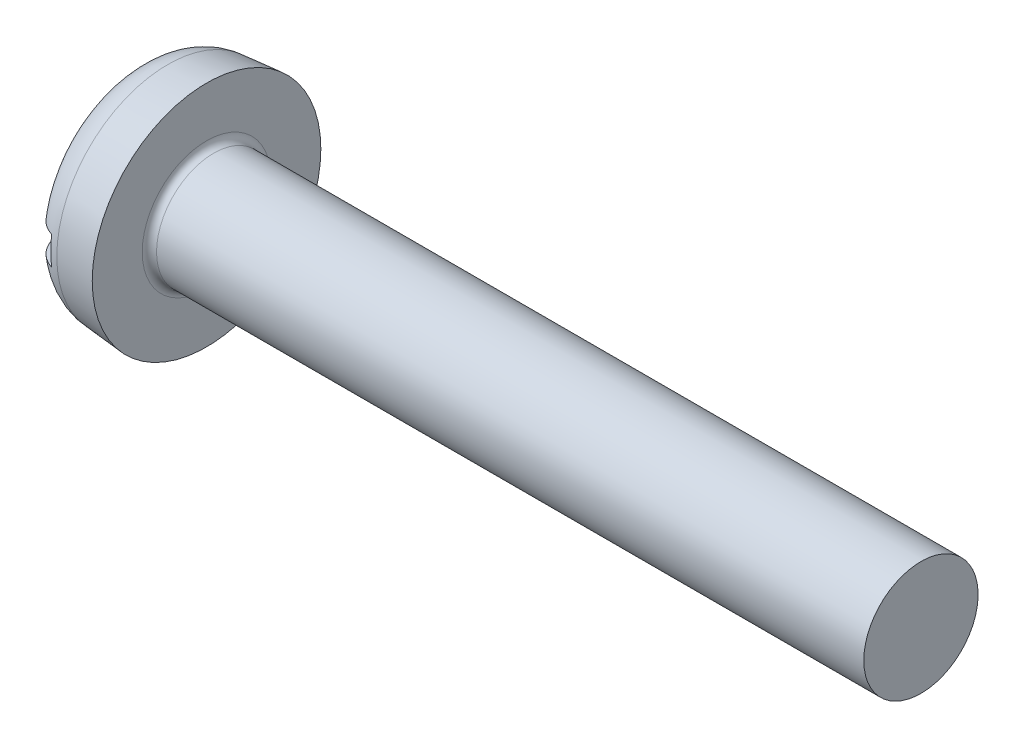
ISO-10303-21;
HEADER;
FILE_DESCRIPTION(('STEP AP214'),'2;1');
FILE_NAME('part.step','',(''),(''),'','','');
FILE_SCHEMA(('AUTOMOTIVE_DESIGN { 1 0 10303 214 1 1 1 1 }'));
ENDSEC;
DATA;
#1=APPLICATION_CONTEXT('core data for automotive mechanical design processes');
#2=APPLICATION_PROTOCOL_DEFINITION('international standard','automotive_design',2000,#1);
#3=PRODUCT_CONTEXT('',#1,'mechanical');
#4=PRODUCT('Part','Part','',(#3));
#5=PRODUCT_RELATED_PRODUCT_CATEGORY('part','',(#4));
#6=PRODUCT_DEFINITION_FORMATION('','',#4);
#7=PRODUCT_DEFINITION_CONTEXT('part definition',#1,'design');
#8=PRODUCT_DEFINITION('design','',#6,#7);
#9=PRODUCT_DEFINITION_SHAPE('','',#8);
#10=(LENGTH_UNIT() NAMED_UNIT(*) SI_UNIT(.MILLI.,.METRE.));
#11=(NAMED_UNIT(*) PLANE_ANGLE_UNIT() SI_UNIT($,.RADIAN.));
#12=(NAMED_UNIT(*) SI_UNIT($,.STERADIAN.) SOLID_ANGLE_UNIT());
#13=UNCERTAINTY_MEASURE_WITH_UNIT(LENGTH_MEASURE(1.E-05),#10,'distance_accuracy_value','');
#14=(GEOMETRIC_REPRESENTATION_CONTEXT(3) GLOBAL_UNCERTAINTY_ASSIGNED_CONTEXT((#13)) GLOBAL_UNIT_ASSIGNED_CONTEXT((#10,
#11,#12)) REPRESENTATION_CONTEXT('',''));
#15=CARTESIAN_POINT('',(0.,0.,0.));
#16=DIRECTION('',(0.,0.,1.));
#17=DIRECTION('',(1.,0.,0.));
#18=AXIS2_PLACEMENT_3D('',#15,#16,#17);
#19=CARTESIAN_POINT('',(0.,0.,0.));
#20=DIRECTION('',(1.,0.,0.));
#21=DIRECTION('',(0.,0.,-1.));
#22=AXIS2_PLACEMENT_3D('',#19,#20,#21);
#23=PLANE('',#22);
#24=DIRECTION('',(0.,0.,-1.));
#25=VECTOR('',#24,1.);
#26=CARTESIAN_POINT('',(0.,-0.2,1.6));
#27=LINE('',#26,#25);
#28=CARTESIAN_POINT('',(0.,-0.2,1.03520285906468));
#29=VERTEX_POINT('',#28);
#30=CARTESIAN_POINT('',(0.,-0.2,-1.03520285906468));
#31=VERTEX_POINT('',#30);
#32=EDGE_CURVE('E99',#29,#31,#27,.T.);
#33=ORIENTED_EDGE('',*,*,#32,.T.);
#34=CARTESIAN_POINT('',(0.,0.,0.));
#35=DIRECTION('',(1.,0.,0.));
#36=DIRECTION('',(0.,0.,-1.));
#37=AXIS2_PLACEMENT_3D('',#34,#35,#36);
#38=CIRCLE('',#37,1.05434574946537);
#39=EDGE_CURVE('E108',#31,#29,#38,.F.);
#40=ORIENTED_EDGE('',*,*,#39,.T.);
#41=EDGE_LOOP('',(#33,#40));
#42=FACE_BOUND('',#41,.T.);
#43=ADVANCED_FACE('F45',(#42),#23,.F.);
#44=DIRECTION('',(0.,0.,1.));
#45=VECTOR('',#44,1.);
#46=CARTESIAN_POINT('',(0.,0.2,1.6));
#47=LINE('',#46,#45);
#48=CARTESIAN_POINT('',(0.,0.2,-1.03520285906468));
#49=VERTEX_POINT('',#48);
#50=CARTESIAN_POINT('',(0.,0.2,1.03520285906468));
#51=VERTEX_POINT('',#50);
#52=EDGE_CURVE('E89',#49,#51,#47,.T.);
#53=ORIENTED_EDGE('',*,*,#52,.T.);
#54=EDGE_CURVE('E102',#51,#49,#38,.F.);
#55=ORIENTED_EDGE('',*,*,#54,.T.);
#56=EDGE_LOOP('',(#53,#55));
#57=FACE_BOUND('',#56,.T.);
#58=ADVANCED_FACE('F107',(#57),#23,.F.);
#59=CARTESIAN_POINT('',(0.5,0.,0.));
#60=DIRECTION('',(1.,0.,0.));
#61=DIRECTION('',(0.,0.,-1.));
#62=AXIS2_PLACEMENT_3D('',#59,#60,#61);
#63=TOROIDAL_SURFACE('',#62,1.05434574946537,0.5);
#64=CARTESIAN_POINT('',(0.456422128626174,0.,0.));
#65=DIRECTION('',(-1.,0.,0.));
#66=DIRECTION('',(0.,0.,1.));
#67=AXIS2_PLACEMENT_3D('',#64,#65,#66);
#68=CIRCLE('',#67,1.55244309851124);
#69=CARTESIAN_POINT('',(0.456422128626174,0.,1.55244309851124));
#70=VERTEX_POINT('',#69);
#71=EDGE_CURVE('E112',#70,#70,#68,.F.);
#72=ORIENTED_EDGE('',*,*,#71,.F.);
#73=EDGE_LOOP('',(#72));
#74=FACE_BOUND('',#73,.T.);
#75=CARTESIAN_POINT('',(0.35,0.,0.));
#76=DIRECTION('',(1.,0.,0.));
#77=DIRECTION('',(0.,0.,-1.));
#78=AXIS2_PLACEMENT_3D('',#75,#76,#77);
#79=CIRCLE('',#78,1.53131535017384);
#80=CARTESIAN_POINT('',(0.35,-0.2,1.51819850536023));
#81=VERTEX_POINT('',#80);
#82=CARTESIAN_POINT('',(0.35,0.2,1.51819850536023));
#83=VERTEX_POINT('',#82);
#84=EDGE_CURVE('E70',#81,#83,#79,.F.);
#85=ORIENTED_EDGE('',*,*,#84,.F.);
#86=CARTESIAN_POINT('',(0.176812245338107,-0.2,0.642423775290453));
#87=CARTESIAN_POINT('',(0.197656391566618,-0.2,0.623931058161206));
#88=CARTESIAN_POINT('',(0.220003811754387,-0.2,0.60711059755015));
#89=CARTESIAN_POINT('',(0.267180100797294,-0.2,0.577365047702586));
#90=CARTESIAN_POINT('',(0.292010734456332,-0.2,0.56444275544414));
#91=CARTESIAN_POINT('',(0.343577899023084,-0.2,0.54298514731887));
#92=CARTESIAN_POINT('',(0.370318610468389,-0.2,0.534459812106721));
#93=CARTESIAN_POINT('',(0.424877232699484,-0.2,0.522255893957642));
#94=CARTESIAN_POINT('',(0.452694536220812,-0.2,0.518574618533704));
#95=CARTESIAN_POINT('',(0.507347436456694,-0.2,0.516300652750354));
#96=CARTESIAN_POINT('',(0.534174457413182,-0.2,0.517498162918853));
#97=CARTESIAN_POINT('',(0.587230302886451,-0.2,0.524448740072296));
#98=CARTESIAN_POINT('',(0.613459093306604,-0.2,0.530202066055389));
#99=CARTESIAN_POINT('',(0.664260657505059,-0.2,0.545888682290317));
#100=CARTESIAN_POINT('',(0.688850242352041,-0.2,0.555767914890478));
#101=CARTESIAN_POINT('',(0.736143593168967,-0.2,0.579309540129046));
#102=CARTESIAN_POINT('',(0.758846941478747,-0.2,0.592972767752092));
#103=CARTESIAN_POINT('',(0.80300214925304,-0.2,0.624449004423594));
#104=CARTESIAN_POINT('',(0.824325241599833,-0.2,0.642442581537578));
#105=CARTESIAN_POINT('',(0.863838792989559,-0.2,0.681591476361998));
#106=CARTESIAN_POINT('',(0.882028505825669,-0.2,0.702747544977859));
#107=CARTESIAN_POINT('',(0.915707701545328,-0.2,0.748831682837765));
#108=CARTESIAN_POINT('',(0.931007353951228,-0.2,0.773898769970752));
#109=CARTESIAN_POINT('',(0.957255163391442,-0.2,0.826217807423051));
#110=CARTESIAN_POINT('',(0.968202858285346,-0.2,0.85346998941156));
#111=CARTESIAN_POINT('',(0.985551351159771,-0.2,0.909833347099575));
#112=CARTESIAN_POINT('',(0.991882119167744,-0.2,0.938966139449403));
#113=CARTESIAN_POINT('',(0.999504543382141,-0.2,0.997884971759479));
#114=CARTESIAN_POINT('',(1.00079638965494,-0.2,1.02767098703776));
#115=CARTESIAN_POINT('',(0.998270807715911,-0.2,1.08670057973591));
#116=CARTESIAN_POINT('',(0.994509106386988,-0.2,1.11594652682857));
#117=CARTESIAN_POINT('',(0.98203838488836,-0.2,1.1733647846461));
#118=CARTESIAN_POINT('',(0.973329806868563,-0.2,1.2015371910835));
#119=CARTESIAN_POINT('',(0.951381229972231,-0.2,1.25547754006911));
#120=CARTESIAN_POINT('',(0.938224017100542,-0.2,1.28127917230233));
#121=CARTESIAN_POINT('',(0.907700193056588,-0.2,1.3302597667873));
#122=CARTESIAN_POINT('',(0.890333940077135,-0.2,1.3534389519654));
#123=CARTESIAN_POINT('',(0.852175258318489,-0.2,1.39614558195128));
#124=CARTESIAN_POINT('',(0.83143906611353,-0.2,1.41572328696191));
#125=CARTESIAN_POINT('',(0.786943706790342,-0.2,1.45107407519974));
#126=CARTESIAN_POINT('',(0.763184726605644,-0.2,1.46684739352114));
#127=CARTESIAN_POINT('',(0.713591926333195,-0.2,1.49397124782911));
#128=CARTESIAN_POINT('',(0.687782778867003,-0.2,1.5053669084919));
#129=CARTESIAN_POINT('',(0.634610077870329,-0.2,1.52363335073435));
#130=CARTESIAN_POINT('',(0.607246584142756,-0.2,1.53050430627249));
#131=CARTESIAN_POINT('',(0.551920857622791,-0.2,1.53948979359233));
#132=CARTESIAN_POINT('',(0.523963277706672,-0.2,1.54163299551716));
#133=CARTESIAN_POINT('',(0.468086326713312,-0.2,1.54118492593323));
#134=CARTESIAN_POINT('',(0.440166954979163,-0.2,1.53859373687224));
#135=CARTESIAN_POINT('',(0.385217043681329,-0.2,1.52876323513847));
#136=CARTESIAN_POINT('',(0.358184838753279,-0.2,1.5215332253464));
#137=CARTESIAN_POINT('',(0.305714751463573,-0.2,1.50264566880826));
#138=CARTESIAN_POINT('',(0.280276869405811,-0.2,1.49098812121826));
#139=CARTESIAN_POINT('',(0.231662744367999,-0.2,1.4635592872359));
#140=CARTESIAN_POINT('',(0.208490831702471,-0.2,1.4477803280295));
#141=CARTESIAN_POINT('',(0.165105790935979,-0.2,1.41257713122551));
#142=CARTESIAN_POINT('',(0.144892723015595,-0.2,1.39315281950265));
#143=CARTESIAN_POINT('',(0.107866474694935,-0.2,1.35109338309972));
#144=CARTESIAN_POINT('',(0.0910739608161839,-0.2,1.32844006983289));
#145=CARTESIAN_POINT('',(0.0614863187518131,-0.2,1.28065921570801));
#146=CARTESIAN_POINT('',(0.048691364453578,-0.2,1.25553156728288));
#147=CARTESIAN_POINT('',(0.0273148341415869,-0.2,1.20324342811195));
#148=CARTESIAN_POINT('',(0.0187777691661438,-0.2,1.17606474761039));
#149=CARTESIAN_POINT('',(0.00631625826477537,-0.2,1.12067195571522));
#150=CARTESIAN_POINT('',(0.00239193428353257,-0.2,1.09245781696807));
#151=CARTESIAN_POINT('',(-0.000800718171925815,-0.2,1.03535487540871));
#152=CARTESIAN_POINT('',(-2.5416709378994E-07,-0.2,1.00646223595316));
#153=CARTESIAN_POINT('',(0.00635345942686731,-0.2,0.949197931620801));
#154=CARTESIAN_POINT('',(0.0119082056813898,-0.2,0.920826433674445));
#155=CARTESIAN_POINT('',(0.0277231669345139,-0.2,0.864879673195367));
#156=CARTESIAN_POINT('',(0.0380658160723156,-0.2,0.837327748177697));
#157=CARTESIAN_POINT('',(0.0631658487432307,-0.2,0.784336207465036));
#158=CARTESIAN_POINT('',(0.0779192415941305,-0.2,0.758894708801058));
#159=CARTESIAN_POINT('',(0.106480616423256,-0.2,0.71790872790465));
#160=CARTESIAN_POINT('',(0.119286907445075,-0.2,0.701656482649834));
#161=CARTESIAN_POINT('',(0.146723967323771,-0.2,0.670770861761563));
#162=CARTESIAN_POINT('',(0.16135475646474,-0.2,0.656137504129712));
#163=CARTESIAN_POINT('',(0.176812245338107,-0.2,0.642423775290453));
#164=B_SPLINE_CURVE_WITH_KNOTS('',3,(#86,#87,#88,#89,#90,#91,#92,#93,#94,#95,#96,#97,#98,#99,
#100,#101,#102,#103,#104,#105,#106,#107,#108,#109,#110,#111,#112,#113,#114,#115,#116,#117,#118,
#119,#120,#121,#122,#123,#124,#125,#126,#127,#128,#129,#130,#131,#132,#133,#134,#135,#136,#137,
#138,#139,#140,#141,#142,#143,#144,#145,#146,#147,#148,#149,#150,#151,#152,#153,#154,#155,#156,
#157,#158,#159,#160,#161,#162,#163),.UNSPECIFIED.,.T.,.F.,(4,2,2,2,2,2,2,2,2,2,2,2,2,2,2,2,2,2,
2,2,2,2,2,2,2,2,2,2,2,2,2,2,2,2,2,2,2,2,4),(0.,0.0835254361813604,0.16711066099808,
0.250884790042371,0.334612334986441,0.414778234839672,0.494948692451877,0.57410016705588,
0.65326912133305,0.736605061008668,0.819960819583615,0.907655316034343,0.995359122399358,
1.08436702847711,1.17337157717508,1.26140266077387,1.3494258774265,1.43589378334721,
1.52235433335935,1.60749748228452,1.69263536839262,1.77687047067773,1.86110233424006,
1.94482197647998,2.02854016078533,2.11209097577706,2.19564180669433,2.2793493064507,
2.36305850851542,2.44725937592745,2.53146390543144,2.61653114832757,2.70160064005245,
2.78791176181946,2.87425006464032,2.96213355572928,3.04993777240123,3.11187742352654,
3.17381776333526),.UNSPECIFIED.);
#165=EDGE_CURVE('E11',#81,#29,#164,.T.);
#166=ORIENTED_EDGE('',*,*,#165,.T.);
#167=ORIENTED_EDGE('',*,*,#39,.F.);
#168=CARTESIAN_POINT('',(0.209021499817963,-0.2,-1.44720111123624));
#169=CARTESIAN_POINT('',(0.231659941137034,-0.2,-1.46355413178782));
#170=CARTESIAN_POINT('',(0.255689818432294,-0.2,-1.47801452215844));
#171=CARTESIAN_POINT('',(0.305854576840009,-0.2,-1.50271047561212));
#172=CARTESIAN_POINT('',(0.331991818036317,-0.2,-1.51294122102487));
#173=CARTESIAN_POINT('',(0.385609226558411,-0.2,-1.52885984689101));
#174=CARTESIAN_POINT('',(0.413088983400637,-0.2,-1.53454910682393));
#175=CARTESIAN_POINT('',(0.468607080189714,-0.2,-1.54121911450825));
#176=CARTESIAN_POINT('',(0.496645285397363,-0.2,-1.5422009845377));
#177=CARTESIAN_POINT('',(0.552422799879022,-0.2,-1.53943414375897));
#178=CARTESIAN_POINT('',(0.58016264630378,-0.2,-1.53569625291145));
#179=CARTESIAN_POINT('',(0.63462205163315,-0.2,-1.52361782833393));
#180=CARTESIAN_POINT('',(0.661341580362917,-0.2,-1.51527715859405));
#181=CARTESIAN_POINT('',(0.713015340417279,-0.2,-1.49423300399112));
#182=CARTESIAN_POINT('',(0.737968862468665,-0.2,-1.48152777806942));
#183=CARTESIAN_POINT('',(0.785400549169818,-0.2,-1.4521254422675));
#184=CARTESIAN_POINT('',(0.80787868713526,-0.2,-1.43542828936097));
#185=CARTESIAN_POINT('',(0.849830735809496,-0.2,-1.39844426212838));
#186=CARTESIAN_POINT('',(0.869291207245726,-0.2,-1.37814214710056));
#187=CARTESIAN_POINT('',(0.904561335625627,-0.2,-1.33458309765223));
#188=CARTESIAN_POINT('',(0.920370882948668,-0.2,-1.31132607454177));
#189=CARTESIAN_POINT('',(0.948041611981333,-0.2,-1.26230898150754));
#190=CARTESIAN_POINT('',(0.959867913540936,-0.2,-1.23652922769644));
#191=CARTESIAN_POINT('',(0.979086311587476,-0.2,-1.18336789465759));
#192=CARTESIAN_POINT('',(0.986478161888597,-0.2,-1.15598622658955));
#193=CARTESIAN_POINT('',(0.99672785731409,-0.2,-1.10001821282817));
#194=CARTESIAN_POINT('',(0.999525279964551,-0.2,-1.07142080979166));
#195=CARTESIAN_POINT('',(1.00036372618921,-0.2,-1.01415726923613));
#196=CARTESIAN_POINT('',(0.998404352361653,-0.2,-0.985491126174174));
#197=CARTESIAN_POINT('',(0.989750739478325,-0.2,-0.928387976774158));
#198=CARTESIAN_POINT('',(0.982977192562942,-0.2,-0.899962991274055));
#199=CARTESIAN_POINT('',(0.964831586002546,-0.2,-0.844620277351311));
#200=CARTESIAN_POINT('',(0.953459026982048,-0.2,-0.817702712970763));
#201=CARTESIAN_POINT('',(0.926225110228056,-0.2,-0.765686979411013));
#202=CARTESIAN_POINT('',(0.910294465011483,-0.2,-0.740625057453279));
#203=CARTESIAN_POINT('',(0.874457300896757,-0.2,-0.693518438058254));
#204=CARTESIAN_POINT('',(0.854550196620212,-0.2,-0.671474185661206));
#205=CARTESIAN_POINT('',(0.811255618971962,-0.2,-0.631056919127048));
#206=CARTESIAN_POINT('',(0.787864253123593,-0.2,-0.612688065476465));
#207=CARTESIAN_POINT('',(0.738233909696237,-0.2,-0.580307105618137));
#208=CARTESIAN_POINT('',(0.711995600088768,-0.2,-0.566293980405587));
#209=CARTESIAN_POINT('',(0.658411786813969,-0.2,-0.543651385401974));
#210=CARTESIAN_POINT('',(0.631141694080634,-0.2,-0.534844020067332));
#211=CARTESIAN_POINT('',(0.575466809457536,-0.2,-0.522277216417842));
#212=CARTESIAN_POINT('',(0.547062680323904,-0.2,-0.518514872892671));
#213=CARTESIAN_POINT('',(0.491811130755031,-0.2,-0.51631366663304));
#214=CARTESIAN_POINT('',(0.464975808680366,-0.2,-0.517560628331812));
#215=CARTESIAN_POINT('',(0.411912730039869,-0.2,-0.524611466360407));
#216=CARTESIAN_POINT('',(0.385684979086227,-0.2,-0.530415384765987));
#217=CARTESIAN_POINT('',(0.334899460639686,-0.2,-0.546200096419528));
#218=CARTESIAN_POINT('',(0.310324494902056,-0.2,-0.556125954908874));
#219=CARTESIAN_POINT('',(0.263066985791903,-0.2,-0.579757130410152));
#220=CARTESIAN_POINT('',(0.240384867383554,-0.2,-0.593463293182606));
#221=CARTESIAN_POINT('',(0.196274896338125,-0.2,-0.625026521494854));
#222=CARTESIAN_POINT('',(0.174976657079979,-0.2,-0.64306465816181));
#223=CARTESIAN_POINT('',(0.135520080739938,-0.2,-0.682298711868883));
#224=CARTESIAN_POINT('',(0.117362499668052,-0.2,-0.703495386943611));
#225=CARTESIAN_POINT('',(0.0837592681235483,-0.2,-0.749654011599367));
#226=CARTESIAN_POINT('',(0.0685031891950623,-0.2,-0.774754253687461));
#227=CARTESIAN_POINT('',(0.0423483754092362,-0.2,-0.827132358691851));
#228=CARTESIAN_POINT('',(0.0314501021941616,-0.2,-0.854410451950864));
#229=CARTESIAN_POINT('',(0.014207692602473,-0.2,-0.910812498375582));
#230=CARTESIAN_POINT('',(0.00793278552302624,-0.2,-0.939957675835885));
#231=CARTESIAN_POINT('',(0.000424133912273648,-0.2,-0.998890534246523));
#232=CARTESIAN_POINT('',(-0.000809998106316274,-0.2,-1.02867816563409));
#233=CARTESIAN_POINT('',(0.00182976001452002,-0.2,-1.08769522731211));
#234=CARTESIAN_POINT('',(0.00564696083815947,-0.2,-1.11692718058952));
#235=CARTESIAN_POINT('',(0.0182271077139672,-0.2,-1.17431618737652));
#236=CARTESIAN_POINT('',(0.0269908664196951,-0.2,-1.20247306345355));
#237=CARTESIAN_POINT('',(0.0490488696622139,-0.2,-1.25638422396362));
#238=CARTESIAN_POINT('',(0.0622626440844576,-0.2,-1.28217148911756));
#239=CARTESIAN_POINT('',(0.0928885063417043,-0.2,-1.33108922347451));
#240=CARTESIAN_POINT('',(0.110295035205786,-0.2,-1.35422315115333));
#241=CARTESIAN_POINT('',(0.141464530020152,-0.2,-1.38897530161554));
#242=CARTESIAN_POINT('',(0.154095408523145,-0.2,-1.40162696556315));
#243=CARTESIAN_POINT('',(0.180635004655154,-0.2,-1.42551080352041));
#244=CARTESIAN_POINT('',(0.194543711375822,-0.2,-1.43674298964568));
#245=CARTESIAN_POINT('',(0.209021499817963,-0.2,-1.44720111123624));
#246=B_SPLINE_CURVE_WITH_KNOTS('',3,(#168,#169,#170,#171,#172,#173,#174,#175,#176,#177,#178,
#179,#180,#181,#182,#183,#184,#185,#186,#187,#188,#189,#190,#191,#192,#193,#194,#195,#196,#197,
#198,#199,#200,#201,#202,#203,#204,#205,#206,#207,#208,#209,#210,#211,#212,#213,#214,#215,#216,
#217,#218,#219,#220,#221,#222,#223,#224,#225,#226,#227,#228,#229,#230,#231,#232,#233,#234,#235,
#236,#237,#238,#239,#240,#241,#242,#243,#244,#245),.UNSPECIFIED.,.T.,.F.,(4,2,2,2,2,2,2,2,2,2,2,
2,2,2,2,2,2,2,2,2,2,2,2,2,2,2,2,2,2,2,2,2,2,2,2,2,2,2,4),(0.,0.0837163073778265,
0.16752770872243,0.251313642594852,0.33507960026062,0.41865387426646,0.502230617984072,
0.585840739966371,0.669451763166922,0.753425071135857,0.837400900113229,0.922094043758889,
1.00679188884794,1.09259494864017,1.17840517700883,1.26566280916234,1.35292991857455,
1.44160130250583,1.53028574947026,1.61907002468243,1.70783351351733,1.79335589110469,
1.87882899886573,1.95902771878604,2.03922717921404,2.11839044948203,2.19757144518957,
2.28093653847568,2.36432167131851,2.45203291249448,2.53975344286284,2.62876217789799,
2.71776407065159,2.80577554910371,2.8938014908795,2.98031424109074,3.06671291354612,
3.1202518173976,3.17379026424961),.UNSPECIFIED.);
#247=CARTESIAN_POINT('',(0.35,-0.2,-1.51819850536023));
#248=VERTEX_POINT('',#247);
#249=EDGE_CURVE('E105',#31,#248,#246,.T.);
#250=ORIENTED_EDGE('',*,*,#249,.T.);
#251=CARTESIAN_POINT('',(0.35,0.2,-1.51819850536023));
#252=VERTEX_POINT('',#251);
#253=EDGE_CURVE('E104',#252,#248,#79,.F.);
#254=ORIENTED_EDGE('',*,*,#253,.F.);
#255=CARTESIAN_POINT('',(0.209021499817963,0.2,-1.44720111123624));
#256=CARTESIAN_POINT('',(0.186122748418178,0.2,-1.43065687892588));
#257=CARTESIAN_POINT('',(0.164613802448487,0.2,-1.4121511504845));
#258=CARTESIAN_POINT('',(0.125002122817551,0.2,-1.37176488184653));
#259=CARTESIAN_POINT('',(0.106903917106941,0.2,-1.34987992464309));
#260=CARTESIAN_POINT('',(0.0746460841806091,0.2,-1.30340745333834));
#261=CARTESIAN_POINT('',(0.0604827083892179,0.2,-1.27882254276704));
#262=CARTESIAN_POINT('',(0.036448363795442,0.2,-1.2276478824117));
#263=CARTESIAN_POINT('',(0.0265763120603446,0.2,-1.20105864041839));
#264=CARTESIAN_POINT('',(0.0112893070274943,0.2,-1.14637257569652));
#265=CARTESIAN_POINT('',(0.00591501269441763,0.2,-1.11826439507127));
#266=CARTESIAN_POINT('',(-0.000118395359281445,0.2,-1.06154626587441));
#267=CARTESIAN_POINT('',(-0.000776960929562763,0.2,-1.03293625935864));
#268=CARTESIAN_POINT('',(0.00262524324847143,0.2,-0.975538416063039));
#269=CARTESIAN_POINT('',(0.00676182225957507,0.2,-0.946755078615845));
#270=CARTESIAN_POINT('',(0.0197241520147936,0.2,-0.890264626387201));
#271=CARTESIAN_POINT('',(0.028550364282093,0.2,-0.86255761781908));
#272=CARTESIAN_POINT('',(0.050814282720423,0.2,-0.808503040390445));
#273=CARTESIAN_POINT('',(0.0643286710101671,0.2,-0.782187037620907));
#274=CARTESIAN_POINT('',(0.0955507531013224,0.2,-0.732167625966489));
#275=CARTESIAN_POINT('',(0.113259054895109,0.2,-0.708464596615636));
#276=CARTESIAN_POINT('',(0.152545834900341,0.2,-0.664194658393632));
#277=CARTESIAN_POINT('',(0.174152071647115,0.2,-0.643652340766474));
#278=CARTESIAN_POINT('',(0.220581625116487,0.2,-0.606587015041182));
#279=CARTESIAN_POINT('',(0.245404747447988,0.2,-0.590063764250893));
#280=CARTESIAN_POINT('',(0.296954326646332,0.2,-0.562026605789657));
#281=CARTESIAN_POINT('',(0.323619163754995,0.2,-0.550399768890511));
#282=CARTESIAN_POINT('',(0.378598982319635,0.2,-0.532119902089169));
#283=CARTESIAN_POINT('',(0.406912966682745,0.2,-0.525463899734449));
#284=CARTESIAN_POINT('',(0.462540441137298,0.2,-0.517724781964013));
#285=CARTESIAN_POINT('',(0.489810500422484,0.2,-0.516328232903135));
#286=CARTESIAN_POINT('',(0.544173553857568,0.2,-0.518310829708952));
#287=CARTESIAN_POINT('',(0.571266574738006,0.2,-0.521689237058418));
#288=CARTESIAN_POINT('',(0.623579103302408,0.2,-0.532854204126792));
#289=CARTESIAN_POINT('',(0.64883094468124,0.2,-0.540490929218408));
#290=CARTESIAN_POINT('',(0.697772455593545,0.2,-0.559732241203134));
#291=CARTESIAN_POINT('',(0.72146180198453,0.2,-0.571337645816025));
#292=CARTESIAN_POINT('',(0.767640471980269,0.2,-0.598638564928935));
#293=CARTESIAN_POINT('',(0.790043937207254,0.2,-0.614479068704));
#294=CARTESIAN_POINT('',(0.832065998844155,0.2,-0.649500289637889));
#295=CARTESIAN_POINT('',(0.851683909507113,0.2,-0.668681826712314));
#296=CARTESIAN_POINT('',(0.888752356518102,0.2,-0.711069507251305));
#297=CARTESIAN_POINT('',(0.906009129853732,0.2,-0.734445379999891));
#298=CARTESIAN_POINT('',(0.936469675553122,0.2,-0.783705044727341));
#299=CARTESIAN_POINT('',(0.949672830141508,0.2,-0.809589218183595));
#300=CARTESIAN_POINT('',(0.97193850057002,0.2,-0.863845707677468));
#301=CARTESIAN_POINT('',(0.980889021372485,0.2,-0.892264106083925));
#302=CARTESIAN_POINT('',(0.993860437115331,0.2,-0.950205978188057));
#303=CARTESIAN_POINT('',(0.997881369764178,0.2,-0.979729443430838));
#304=CARTESIAN_POINT('',(1.00082434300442,0.2,-1.03884993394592));
#305=CARTESIAN_POINT('',(0.999777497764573,0.2,-1.0684453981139));
#306=CARTESIAN_POINT('',(0.992639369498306,0.2,-1.12702257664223));
#307=CARTESIAN_POINT('',(0.986548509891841,0.2,-1.15600434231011));
#308=CARTESIAN_POINT('',(0.969607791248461,0.2,-1.21199828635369));
#309=CARTESIAN_POINT('',(0.958841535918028,0.2,-1.23903575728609));
#310=CARTESIAN_POINT('',(0.932848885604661,0.2,-1.29087503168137));
#311=CARTESIAN_POINT('',(0.917622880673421,0.2,-1.31567703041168));
#312=CARTESIAN_POINT('',(0.883415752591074,0.2,-1.36191456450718));
#313=CARTESIAN_POINT('',(0.864499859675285,0.2,-1.38339836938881));
#314=CARTESIAN_POINT('',(0.823290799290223,0.2,-1.42283763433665));
#315=CARTESIAN_POINT('',(0.800997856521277,0.2,-1.4407933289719));
#316=CARTESIAN_POINT('',(0.753955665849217,0.2,-1.47244698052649));
#317=CARTESIAN_POINT('',(0.729238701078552,0.2,-1.48619292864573));
#318=CARTESIAN_POINT('',(0.677836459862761,0.2,-1.50930448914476));
#319=CARTESIAN_POINT('',(0.651151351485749,0.2,-1.51867047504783));
#320=CARTESIAN_POINT('',(0.596781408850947,0.2,-1.53269216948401));
#321=CARTESIAN_POINT('',(0.569105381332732,0.2,-1.53738204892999));
#322=CARTESIAN_POINT('',(0.513351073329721,0.2,-1.54203383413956));
#323=CARTESIAN_POINT('',(0.485272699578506,0.2,-1.54199462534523));
#324=CARTESIAN_POINT('',(0.429598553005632,0.2,-1.53719466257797));
#325=CARTESIAN_POINT('',(0.402001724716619,0.2,-1.53244605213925));
#326=CARTESIAN_POINT('',(0.34802140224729,0.2,-1.51838664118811));
#327=CARTESIAN_POINT('',(0.321636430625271,0.2,-1.5090815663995));
#328=CARTESIAN_POINT('',(0.280891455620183,0.2,-1.4907390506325));
#329=CARTESIAN_POINT('',(0.265907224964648,0.2,-1.48305487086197));
#330=CARTESIAN_POINT('',(0.236791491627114,0.2,-1.46621276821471));
#331=CARTESIAN_POINT('',(0.222659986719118,0.2,-1.45705484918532));
#332=CARTESIAN_POINT('',(0.209021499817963,0.2,-1.44720111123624));
#333=B_SPLINE_CURVE_WITH_KNOTS('',3,(#255,#256,#257,#258,#259,#260,#261,#262,#263,#264,#265,
#266,#267,#268,#269,#270,#271,#272,#273,#274,#275,#276,#277,#278,#279,#280,#281,#282,#283,#284,
#285,#286,#287,#288,#289,#290,#291,#292,#293,#294,#295,#296,#297,#298,#299,#300,#301,#302,#303,
#304,#305,#306,#307,#308,#309,#310,#311,#312,#313,#314,#315,#316,#317,#318,#319,#320,#321,#322,
#323,#324,#325,#326,#327,#328,#329,#330,#331,#332),.UNSPECIFIED.,.T.,.F.,(4,2,2,2,2,2,2,2,2,2,2,
2,2,2,2,2,2,2,2,2,2,2,2,2,2,2,2,2,2,2,2,2,2,2,2,2,2,2,4),(0.,0.0846878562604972,
0.16948736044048,0.2542057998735,0.338902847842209,0.424357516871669,0.509822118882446,
0.59665652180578,0.683499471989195,0.771835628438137,0.860184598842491,0.949189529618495,
1.03818908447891,1.12500564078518,1.21177024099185,1.29327399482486,1.3747651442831,
1.45355500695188,1.5323611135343,1.61431830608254,1.69629563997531,1.78306560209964,
1.86984878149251,1.95880564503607,2.0477618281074,2.13617255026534,2.22457585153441,
2.31145955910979,2.39833567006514,2.48379618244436,2.56925101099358,2.65369189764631,
2.73812558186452,2.82193763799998,2.90576944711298,2.98938565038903,3.07289704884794,
3.12333723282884,3.17377728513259),.UNSPECIFIED.);
#334=EDGE_CURVE('E92',#252,#49,#333,.T.);
#335=ORIENTED_EDGE('',*,*,#334,.T.);
#336=ORIENTED_EDGE('',*,*,#54,.F.);
#337=CARTESIAN_POINT('',(0.176812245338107,0.2,0.642423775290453));
#338=CARTESIAN_POINT('',(0.154702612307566,0.2,0.662041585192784));
#339=CARTESIAN_POINT('',(0.134253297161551,0.2,0.683570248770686));
#340=CARTESIAN_POINT('',(0.0972327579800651,0.2,0.729775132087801));
#341=CARTESIAN_POINT('',(0.0806680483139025,0.2,0.754456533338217));
#342=CARTESIAN_POINT('',(0.0519072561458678,0.2,0.806221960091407));
#343=CARTESIAN_POINT('',(0.0397074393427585,0.2,0.833303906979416));
#344=CARTESIAN_POINT('',(0.0200236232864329,0.2,0.889118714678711));
#345=CARTESIAN_POINT('',(0.0125376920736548,0.2,0.917850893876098));
#346=CARTESIAN_POINT('',(0.00251353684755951,0.2,0.976217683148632));
#347=CARTESIAN_POINT('',(-1.64442575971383E-05,0.2,1.00585371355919));
#348=CARTESIAN_POINT('',(1.660336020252E-05,0.2,1.06512652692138));
#349=CARTESIAN_POINT('',(0.0025797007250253,0.2,1.09476330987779));
#350=CARTESIAN_POINT('',(0.0126917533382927,0.2,1.1527074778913));
#351=CARTESIAN_POINT('',(0.0201638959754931,0.2,1.18102825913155));
#352=CARTESIAN_POINT('',(0.0398408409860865,0.2,1.2359754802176));
#353=CARTESIAN_POINT('',(0.052045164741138,0.2,1.26260209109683));
#354=CARTESIAN_POINT('',(0.0806073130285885,0.2,1.31291602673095));
#355=CARTESIAN_POINT('',(0.096889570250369,0.2,1.33664625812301));
#356=CARTESIAN_POINT('',(0.133257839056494,0.2,1.38098733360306));
#357=CARTESIAN_POINT('',(0.153343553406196,0.2,1.40159842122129));
#358=CARTESIAN_POINT('',(0.196451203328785,0.2,1.43882523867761));
#359=CARTESIAN_POINT('',(0.219429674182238,0.2,1.45549131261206));
#360=CARTESIAN_POINT('',(0.267878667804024,0.2,1.48468852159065));
#361=CARTESIAN_POINT('',(0.29334906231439,0.2,1.49721986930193));
#362=CARTESIAN_POINT('',(0.345815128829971,0.2,1.517681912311));
#363=CARTESIAN_POINT('',(0.372795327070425,0.2,1.52565229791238));
#364=CARTESIAN_POINT('',(0.427713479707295,0.2,1.53692751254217));
#365=CARTESIAN_POINT('',(0.455651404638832,0.2,1.54023248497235));
#366=CARTESIAN_POINT('',(0.511557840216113,0.2,1.54207504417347));
#367=CARTESIAN_POINT('',(0.539525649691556,0.2,1.54063398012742));
#368=CARTESIAN_POINT('',(0.594821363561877,0.2,1.53307394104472));
#369=CARTESIAN_POINT('',(0.622149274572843,0.2,1.52695501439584));
#370=CARTESIAN_POINT('',(0.675376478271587,0.2,1.51022327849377));
#371=CARTESIAN_POINT('',(0.701276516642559,0.2,1.49961284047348));
#372=CARTESIAN_POINT('',(0.75093561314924,0.2,1.47420824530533));
#373=CARTESIAN_POINT('',(0.774694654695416,0.2,1.45941405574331));
#374=CARTESIAN_POINT('',(0.81948713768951,0.2,1.42601464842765));
#375=CARTESIAN_POINT('',(0.840511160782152,0.2,1.4073968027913));
#376=CARTESIAN_POINT('',(0.879162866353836,0.2,1.36691918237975));
#377=CARTESIAN_POINT('',(0.896790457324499,0.2,1.34505932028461));
#378=CARTESIAN_POINT('',(0.928296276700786,0.2,1.29854787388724));
#379=CARTESIAN_POINT('',(0.942145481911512,0.2,1.27387663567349));
#380=CARTESIAN_POINT('',(0.96556015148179,0.2,1.22258005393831));
#381=CARTESIAN_POINT('',(0.975125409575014,0.2,1.19595461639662));
#382=CARTESIAN_POINT('',(0.989830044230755,0.2,1.14116777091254));
#383=CARTESIAN_POINT('',(0.994915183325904,0.2,1.11299181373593));
#384=CARTESIAN_POINT('',(1.00036331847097,0.2,1.05618799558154));
#385=CARTESIAN_POINT('',(1.00072594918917,0.2,1.02756009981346));
#386=CARTESIAN_POINT('',(0.996728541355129,0.2,0.970172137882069));
#387=CARTESIAN_POINT('',(0.992292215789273,0.2,0.94141739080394));
#388=CARTESIAN_POINT('',(0.978738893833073,0.2,0.885033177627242));
#389=CARTESIAN_POINT('',(0.969621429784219,0.2,0.857403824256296));
#390=CARTESIAN_POINT('',(0.946786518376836,0.2,0.803555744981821));
#391=CARTESIAN_POINT('',(0.932993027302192,0.2,0.777369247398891));
#392=CARTESIAN_POINT('',(0.901235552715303,0.2,0.727655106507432));
#393=CARTESIAN_POINT('',(0.883270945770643,0.2,0.704127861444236));
#394=CARTESIAN_POINT('',(0.843510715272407,0.2,0.660269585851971));
#395=CARTESIAN_POINT('',(0.821689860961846,0.2,0.639961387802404));
#396=CARTESIAN_POINT('',(0.774870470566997,0.2,0.603404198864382));
#397=CARTESIAN_POINT('',(0.749872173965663,0.2,0.587154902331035));
#398=CARTESIAN_POINT('',(0.698057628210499,0.2,0.559713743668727));
#399=CARTESIAN_POINT('',(0.67130506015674,0.2,0.548402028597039));
#400=CARTESIAN_POINT('',(0.616208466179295,0.2,0.530766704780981));
#401=CARTESIAN_POINT('',(0.587865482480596,0.2,0.524439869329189));
#402=CARTESIAN_POINT('',(0.532256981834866,0.2,0.517338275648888));
#403=CARTESIAN_POINT('',(0.505031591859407,0.2,0.516247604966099));
#404=CARTESIAN_POINT('',(0.450800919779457,0.2,0.51881840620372));
#405=CARTESIAN_POINT('',(0.423795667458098,0.2,0.522480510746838));
#406=CARTESIAN_POINT('',(0.371631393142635,0.2,0.534183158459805));
#407=CARTESIAN_POINT('',(0.346441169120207,0.2,0.542086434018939));
#408=CARTESIAN_POINT('',(0.297683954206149,0.2,0.561836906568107));
#409=CARTESIAN_POINT('',(0.274115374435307,0.2,0.573680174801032));
#410=CARTESIAN_POINT('',(0.238350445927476,0.2,0.595303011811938));
#411=CARTESIAN_POINT('',(0.225448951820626,0.2,0.603942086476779));
#412=CARTESIAN_POINT('',(0.200483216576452,0.2,0.622353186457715));
#413=CARTESIAN_POINT('',(0.188418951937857,0.2,0.632125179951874));
#414=CARTESIAN_POINT('',(0.176812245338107,0.2,0.642423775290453));
#415=B_SPLINE_CURVE_WITH_KNOTS('',3,(#337,#338,#339,#340,#341,#342,#343,#344,#345,#346,#347,
#348,#349,#350,#351,#352,#353,#354,#355,#356,#357,#358,#359,#360,#361,#362,#363,#364,#365,#366,
#367,#368,#369,#370,#371,#372,#373,#374,#375,#376,#377,#378,#379,#380,#381,#382,#383,#384,#385,
#386,#387,#388,#389,#390,#391,#392,#393,#394,#395,#396,#397,#398,#399,#400,#401,#402,#403,#404,
#405,#406,#407,#408,#409,#410,#411,#412,#413,#414),.UNSPECIFIED.,.T.,.F.,(4,2,2,2,2,2,2,2,2,2,2,
2,2,2,2,2,2,2,2,2,2,2,2,2,2,2,2,2,2,2,2,2,2,2,2,2,2,2,4),(0.,0.0886172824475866,
0.17738212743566,0.266070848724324,0.354723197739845,0.443522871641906,0.53232374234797,
0.619767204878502,0.707201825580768,0.79312269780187,0.879036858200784,0.963787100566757,
1.04853298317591,1.13252971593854,1.21652386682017,1.30014070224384,1.38375667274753,
1.46732855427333,1.55090108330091,1.63475418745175,1.71860955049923,1.80309197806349,
1.88757847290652,1.97307425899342,2.0585766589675,2.14545850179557,2.23234902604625,
2.32072639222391,2.40911697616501,2.49810887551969,2.58709407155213,2.67377949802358,
2.76040876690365,2.84173954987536,2.92308115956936,3.00193621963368,3.08071288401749,
3.12723485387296,3.17375551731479),.UNSPECIFIED.);
#416=EDGE_CURVE('E58',#51,#83,#415,.T.);
#417=ORIENTED_EDGE('',*,*,#416,.T.);
#418=EDGE_LOOP('',(#85,#166,#167,#250,#254,#335,#336,#417));
#419=FACE_BOUND('',#418,.T.);
#420=ADVANCED_FACE('F47',(#74,#419),#63,.T.);
#421=CARTESIAN_POINT('',(11.,0.8,0.));
#422=DIRECTION('',(-1.,0.,0.));
#423=DIRECTION('',(0.,0.,1.));
#424=AXIS2_PLACEMENT_3D('',#421,#422,#423);
#425=PLANE('',#424);
#426=CARTESIAN_POINT('',(11.,0.,0.));
#427=DIRECTION('',(-1.,0.,0.));
#428=DIRECTION('',(0.,0.,1.));
#429=AXIS2_PLACEMENT_3D('',#426,#427,#428);
#430=CIRCLE('',#429,0.8);
#431=CARTESIAN_POINT('',(11.,0.,0.8));
#432=VERTEX_POINT('',#431);
#433=EDGE_CURVE('E151',#432,#432,#430,.T.);
#434=ORIENTED_EDGE('',*,*,#433,.F.);
#435=EDGE_LOOP('',(#434));
#436=FACE_BOUND('',#435,.T.);
#437=ADVANCED_FACE('F180',(#436),#425,.F.);
#438=CARTESIAN_POINT('',(0.,0.,0.));
#439=DIRECTION('',(-1.,0.,0.));
#440=DIRECTION('',(0.,0.,1.));
#441=AXIS2_PLACEMENT_3D('',#438,#439,#440);
#442=CYLINDRICAL_SURFACE('',#441,0.8);
#443=CARTESIAN_POINT('',(1.1,0.,0.));
#444=DIRECTION('',(-1.,0.,0.));
#445=DIRECTION('',(0.,0.,1.));
#446=AXIS2_PLACEMENT_3D('',#443,#444,#445);
#447=CIRCLE('',#446,0.8);
#448=CARTESIAN_POINT('',(1.1,0.,0.8));
#449=VERTEX_POINT('',#448);
#450=EDGE_CURVE('E109',#449,#449,#447,.F.);
#451=ORIENTED_EDGE('',*,*,#450,.T.);
#452=EDGE_LOOP('',(#451));
#453=FACE_BOUND('',#452,.T.);
#454=ORIENTED_EDGE('',*,*,#433,.T.);
#455=EDGE_LOOP('',(#454));
#456=FACE_BOUND('',#455,.T.);
#457=ADVANCED_FACE('F178',(#453,#456),#442,.T.);
#458=CARTESIAN_POINT('',(1.,1.6,0.));
#459=DIRECTION('',(-1.,0.,0.));
#460=DIRECTION('',(0.,0.,1.));
#461=AXIS2_PLACEMENT_3D('',#458,#459,#460);
#462=PLANE('',#461);
#463=CARTESIAN_POINT('',(1.,0.,0.));
#464=DIRECTION('',(-1.,0.,0.));
#465=DIRECTION('',(0.,0.,1.));
#466=AXIS2_PLACEMENT_3D('',#463,#464,#465);
#467=CIRCLE('',#466,0.9);
#468=CARTESIAN_POINT('',(1.,0.,0.9));
#469=VERTEX_POINT('',#468);
#470=EDGE_CURVE('E114',#469,#469,#467,.T.);
#471=ORIENTED_EDGE('',*,*,#470,.T.);
#472=EDGE_LOOP('',(#471));
#473=FACE_BOUND('',#472,.T.);
#474=CARTESIAN_POINT('',(1.,0.,0.));
#475=DIRECTION('',(-1.,0.,0.));
#476=DIRECTION('',(0.,0.,1.));
#477=AXIS2_PLACEMENT_3D('',#474,#475,#476);
#478=CIRCLE('',#477,1.6);
#479=CARTESIAN_POINT('',(1.,0.,1.6));
#480=VERTEX_POINT('',#479);
#481=EDGE_CURVE('E148',#480,#480,#478,.T.);
#482=ORIENTED_EDGE('',*,*,#481,.F.);
#483=EDGE_LOOP('',(#482));
#484=FACE_BOUND('',#483,.T.);
#485=ADVANCED_FACE('F156',(#473,#484),#462,.F.);
#486=CARTESIAN_POINT('',(1.,0.,0.));
#487=DIRECTION('',(1.,0.,0.));
#488=DIRECTION('',(0.,0.,-1.));
#489=AXIS2_PLACEMENT_3D('',#486,#487,#488);
#490=CONICAL_SURFACE('',#489,1.6,0.08726646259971);
#491=ORIENTED_EDGE('',*,*,#71,.T.);
#492=EDGE_LOOP('',(#491));
#493=FACE_BOUND('',#492,.T.);
#494=ORIENTED_EDGE('',*,*,#481,.T.);
#495=EDGE_LOOP('',(#494));
#496=FACE_BOUND('',#495,.T.);
#497=ADVANCED_FACE('F161',(#493,#496),#490,.T.);
#498=CARTESIAN_POINT('',(1.1,0.,0.));
#499=DIRECTION('',(-1.,0.,0.));
#500=DIRECTION('',(0.,0.,1.));
#501=AXIS2_PLACEMENT_3D('',#498,#499,#500);
#502=TOROIDAL_SURFACE('',#501,0.9,0.1);
#503=ORIENTED_EDGE('',*,*,#450,.F.);
#504=EDGE_LOOP('',(#503));
#505=FACE_BOUND('',#504,.T.);
#506=ORIENTED_EDGE('',*,*,#470,.F.);
#507=EDGE_LOOP('',(#506));
#508=FACE_BOUND('',#507,.T.);
#509=ADVANCED_FACE('F159',(#505,#508),#502,.F.);
#510=CARTESIAN_POINT('',(0.35,-0.2,1.6));
#511=DIRECTION('',(0.,1.,0.));
#512=DIRECTION('',(0.,0.,1.));
#513=AXIS2_PLACEMENT_3D('',#510,#511,#512);
#514=PLANE('',#513);
#515=ORIENTED_EDGE('',*,*,#32,.F.);
#516=ORIENTED_EDGE('',*,*,#165,.F.);
#517=DIRECTION('',(0.,0.,-1.));
#518=VECTOR('',#517,1.);
#519=CARTESIAN_POINT('',(0.35,-0.2,1.6));
#520=LINE('',#519,#518);
#521=EDGE_CURVE('E98',#81,#248,#520,.T.);
#522=ORIENTED_EDGE('',*,*,#521,.T.);
#523=ORIENTED_EDGE('',*,*,#249,.F.);
#524=EDGE_LOOP('',(#515,#516,#522,#523));
#525=FACE_BOUND('',#524,.T.);
#526=ADVANCED_FACE('F132',(#525),#514,.T.);
#527=CARTESIAN_POINT('',(0.35,0.2,1.6));
#528=DIRECTION('',(0.,-1.,0.));
#529=DIRECTION('',(0.,0.,-1.));
#530=AXIS2_PLACEMENT_3D('',#527,#528,#529);
#531=PLANE('',#530);
#532=DIRECTION('',(0.,0.,1.));
#533=VECTOR('',#532,1.);
#534=CARTESIAN_POINT('',(0.35,0.2,1.6));
#535=LINE('',#534,#533);
#536=EDGE_CURVE('E65',#252,#83,#535,.T.);
#537=ORIENTED_EDGE('',*,*,#536,.T.);
#538=ORIENTED_EDGE('',*,*,#416,.F.);
#539=ORIENTED_EDGE('',*,*,#52,.F.);
#540=ORIENTED_EDGE('',*,*,#334,.F.);
#541=EDGE_LOOP('',(#537,#538,#539,#540));
#542=FACE_BOUND('',#541,.T.);
#543=ADVANCED_FACE('F91',(#542),#531,.T.);
#544=CARTESIAN_POINT('',(0.35,-0.2,1.6));
#545=DIRECTION('',(1.,0.,0.));
#546=DIRECTION('',(0.,0.,-1.));
#547=AXIS2_PLACEMENT_3D('',#544,#545,#546);
#548=PLANE('',#547);
#549=ORIENTED_EDGE('',*,*,#84,.T.);
#550=ORIENTED_EDGE('',*,*,#536,.F.);
#551=ORIENTED_EDGE('',*,*,#253,.T.);
#552=ORIENTED_EDGE('',*,*,#521,.F.);
#553=EDGE_LOOP('',(#549,#550,#551,#552));
#554=FACE_BOUND('',#553,.T.);
#555=ADVANCED_FACE('F131',(#554),#548,.F.);
#556=CLOSED_SHELL('',(#43,#58,#420,#437,#457,#485,#497,#509,#526,#543,#555));
#557=MANIFOLD_SOLID_BREP('B2',#556);
#558=ADVANCED_BREP_SHAPE_REPRESENTATION('',(#18,#557),#14);
#559=SHAPE_DEFINITION_REPRESENTATION(#9,#558);
ENDSEC;
END-ISO-10303-21;
